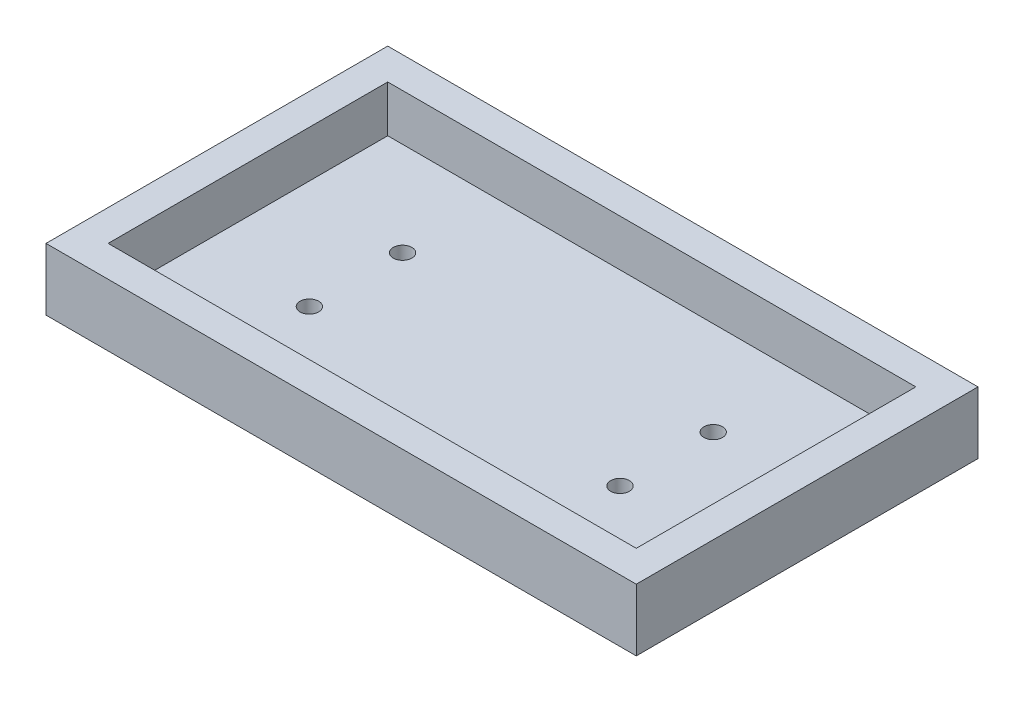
ISO-10303-21;
HEADER;
FILE_DESCRIPTION(('STEP AP214'),'2;1');
FILE_NAME('part.step','',(''),(''),'','','');
FILE_SCHEMA(('AUTOMOTIVE_DESIGN { 1 0 10303 214 1 1 1 1 }'));
ENDSEC;
DATA;
#1=APPLICATION_CONTEXT('core data for automotive mechanical design processes');
#2=APPLICATION_PROTOCOL_DEFINITION('international standard','automotive_design',2000,#1);
#3=PRODUCT_CONTEXT('',#1,'mechanical');
#4=PRODUCT('Part','Part','',(#3));
#5=PRODUCT_RELATED_PRODUCT_CATEGORY('part','',(#4));
#6=PRODUCT_DEFINITION_FORMATION('','',#4);
#7=PRODUCT_DEFINITION_CONTEXT('part definition',#1,'design');
#8=PRODUCT_DEFINITION('design','',#6,#7);
#9=PRODUCT_DEFINITION_SHAPE('','',#8);
#10=(LENGTH_UNIT() NAMED_UNIT(*) SI_UNIT(.MILLI.,.METRE.));
#11=(NAMED_UNIT(*) PLANE_ANGLE_UNIT() SI_UNIT($,.RADIAN.));
#12=(NAMED_UNIT(*) SI_UNIT($,.STERADIAN.) SOLID_ANGLE_UNIT());
#13=UNCERTAINTY_MEASURE_WITH_UNIT(LENGTH_MEASURE(1.E-05),#10,'distance_accuracy_value','');
#14=(GEOMETRIC_REPRESENTATION_CONTEXT(3) GLOBAL_UNCERTAINTY_ASSIGNED_CONTEXT((#13)) GLOBAL_UNIT_ASSIGNED_CONTEXT((#10,
#11,#12)) REPRESENTATION_CONTEXT('',''));
#15=CARTESIAN_POINT('',(0.,0.,0.));
#16=DIRECTION('',(0.,0.,1.));
#17=DIRECTION('',(1.,0.,0.));
#18=AXIS2_PLACEMENT_3D('',#15,#16,#17);
#19=CARTESIAN_POINT('',(0.,15.,0.));
#20=DIRECTION('',(0.,-1.,0.));
#21=DIRECTION('',(0.,0.,-1.));
#22=AXIS2_PLACEMENT_3D('',#19,#20,#21);
#23=PLANE('',#22);
#24=DIRECTION('',(0.,0.,1.));
#25=VECTOR('',#24,1.);
#26=CARTESIAN_POINT('',(-24.5700636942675,15.,94.984076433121));
#27=LINE('',#26,#25);
#28=CARTESIAN_POINT('',(-24.5700636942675,15.,-15.015923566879));
#29=VERTEX_POINT('',#28);
#30=CARTESIAN_POINT('',(-24.5700636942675,15.,94.984076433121));
#31=VERTEX_POINT('',#30);
#32=EDGE_CURVE('E113',#29,#31,#27,.T.);
#33=ORIENTED_EDGE('',*,*,#32,.T.);
#34=DIRECTION('',(1.,0.,0.));
#35=VECTOR('',#34,1.);
#36=CARTESIAN_POINT('',(-24.5700636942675,15.,94.984076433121));
#37=LINE('',#36,#35);
#38=CARTESIAN_POINT('',(165.429936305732,15.,94.984076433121));
#39=VERTEX_POINT('',#38);
#40=EDGE_CURVE('E187',#31,#39,#37,.T.);
#41=ORIENTED_EDGE('',*,*,#40,.T.);
#42=DIRECTION('',(0.,0.,-1.));
#43=VECTOR('',#42,1.);
#44=CARTESIAN_POINT('',(165.429936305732,15.,94.984076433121));
#45=LINE('',#44,#43);
#46=CARTESIAN_POINT('',(165.429936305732,15.,-15.015923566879));
#47=VERTEX_POINT('',#46);
#48=EDGE_CURVE('E190',#39,#47,#45,.T.);
#49=ORIENTED_EDGE('',*,*,#48,.T.);
#50=DIRECTION('',(-1.,0.,0.));
#51=VECTOR('',#50,1.);
#52=CARTESIAN_POINT('',(-24.5700636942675,15.,-15.015923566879));
#53=LINE('',#52,#51);
#54=EDGE_CURVE('E118',#47,#29,#53,.T.);
#55=ORIENTED_EDGE('',*,*,#54,.T.);
#56=EDGE_LOOP('',(#33,#41,#49,#55));
#57=FACE_BOUND('',#56,.T.);
#58=DIRECTION('',(0.,0.,1.));
#59=VECTOR('',#58,1.);
#60=CARTESIAN_POINT('',(-14.5700636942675,15.,-5.015923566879));
#61=LINE('',#60,#59);
#62=CARTESIAN_POINT('',(-14.5700636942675,15.,-5.015923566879));
#63=VERTEX_POINT('',#62);
#64=CARTESIAN_POINT('',(-14.5700636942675,15.,84.984076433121));
#65=VERTEX_POINT('',#64);
#66=EDGE_CURVE('E148',#63,#65,#61,.T.);
#67=ORIENTED_EDGE('',*,*,#66,.F.);
#68=DIRECTION('',(-1.,0.,0.));
#69=VECTOR('',#68,1.);
#70=CARTESIAN_POINT('',(-14.5700636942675,15.,-5.015923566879));
#71=LINE('',#70,#69);
#72=CARTESIAN_POINT('',(155.429936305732,15.,-5.015923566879));
#73=VERTEX_POINT('',#72);
#74=EDGE_CURVE('E158',#73,#63,#71,.T.);
#75=ORIENTED_EDGE('',*,*,#74,.F.);
#76=DIRECTION('',(0.,0.,-1.));
#77=VECTOR('',#76,1.);
#78=CARTESIAN_POINT('',(155.429936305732,15.,-5.015923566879));
#79=LINE('',#78,#77);
#80=CARTESIAN_POINT('',(155.429936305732,15.,84.984076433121));
#81=VERTEX_POINT('',#80);
#82=EDGE_CURVE('E155',#81,#73,#79,.T.);
#83=ORIENTED_EDGE('',*,*,#82,.F.);
#84=DIRECTION('',(1.,0.,0.));
#85=VECTOR('',#84,1.);
#86=CARTESIAN_POINT('',(-14.5700636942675,15.,84.984076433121));
#87=LINE('',#86,#85);
#88=EDGE_CURVE('E151',#65,#81,#87,.T.);
#89=ORIENTED_EDGE('',*,*,#88,.F.);
#90=EDGE_LOOP('',(#67,#75,#83,#89));
#91=FACE_BOUND('',#90,.T.);
#92=ADVANCED_FACE('F39',(#57,#91),#23,.F.);
#93=CARTESIAN_POINT('',(-24.5700636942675,15.,94.984076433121));
#94=DIRECTION('',(1.,0.,0.));
#95=DIRECTION('',(0.,0.,-1.));
#96=AXIS2_PLACEMENT_3D('',#93,#94,#95);
#97=PLANE('',#96);
#98=DIRECTION('',(0.,-1.,0.));
#99=VECTOR('',#98,1.);
#100=CARTESIAN_POINT('',(-24.5700636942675,15.,-15.015923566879));
#101=LINE('',#100,#99);
#102=CARTESIAN_POINT('',(-24.5700636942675,-5.,-15.015923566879));
#103=VERTEX_POINT('',#102);
#104=EDGE_CURVE('E107',#29,#103,#101,.T.);
#105=ORIENTED_EDGE('',*,*,#104,.T.);
#106=DIRECTION('',(0.,0.,-1.));
#107=VECTOR('',#106,1.);
#108=CARTESIAN_POINT('',(-24.5700636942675,-5.,94.984076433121));
#109=LINE('',#108,#107);
#110=CARTESIAN_POINT('',(-24.5700636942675,-5.,94.984076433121));
#111=VERTEX_POINT('',#110);
#112=EDGE_CURVE('E111',#111,#103,#109,.T.);
#113=ORIENTED_EDGE('',*,*,#112,.F.);
#114=DIRECTION('',(0.,-1.,0.));
#115=VECTOR('',#114,1.);
#116=CARTESIAN_POINT('',(-24.5700636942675,15.,94.984076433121));
#117=LINE('',#116,#115);
#118=EDGE_CURVE('E11',#31,#111,#117,.T.);
#119=ORIENTED_EDGE('',*,*,#118,.F.);
#120=ORIENTED_EDGE('',*,*,#32,.F.);
#121=EDGE_LOOP('',(#105,#113,#119,#120));
#122=FACE_BOUND('',#121,.T.);
#123=ADVANCED_FACE('F41',(#122),#97,.F.);
#124=CARTESIAN_POINT('',(-24.5700636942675,15.,94.984076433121));
#125=DIRECTION('',(0.,0.,-1.));
#126=DIRECTION('',(-1.,0.,0.));
#127=AXIS2_PLACEMENT_3D('',#124,#125,#126);
#128=PLANE('',#127);
#129=ORIENTED_EDGE('',*,*,#118,.T.);
#130=DIRECTION('',(-1.,0.,0.));
#131=VECTOR('',#130,1.);
#132=CARTESIAN_POINT('',(-24.5700636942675,-5.,94.984076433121));
#133=LINE('',#132,#131);
#134=CARTESIAN_POINT('',(165.429936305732,-5.,94.984076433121));
#135=VERTEX_POINT('',#134);
#136=EDGE_CURVE('E134',#135,#111,#133,.T.);
#137=ORIENTED_EDGE('',*,*,#136,.F.);
#138=DIRECTION('',(0.,-1.,0.));
#139=VECTOR('',#138,1.);
#140=CARTESIAN_POINT('',(165.429936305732,15.,94.984076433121));
#141=LINE('',#140,#139);
#142=EDGE_CURVE('E48',#39,#135,#141,.T.);
#143=ORIENTED_EDGE('',*,*,#142,.F.);
#144=ORIENTED_EDGE('',*,*,#40,.F.);
#145=EDGE_LOOP('',(#129,#137,#143,#144));
#146=FACE_BOUND('',#145,.T.);
#147=ADVANCED_FACE('F202',(#146),#128,.F.);
#148=CARTESIAN_POINT('',(165.429936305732,15.,94.984076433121));
#149=DIRECTION('',(-1.,0.,0.));
#150=DIRECTION('',(0.,0.,1.));
#151=AXIS2_PLACEMENT_3D('',#148,#149,#150);
#152=PLANE('',#151);
#153=ORIENTED_EDGE('',*,*,#142,.T.);
#154=DIRECTION('',(0.,0.,1.));
#155=VECTOR('',#154,1.);
#156=CARTESIAN_POINT('',(165.429936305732,-5.,94.984076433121));
#157=LINE('',#156,#155);
#158=CARTESIAN_POINT('',(165.429936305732,-5.,-15.015923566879));
#159=VERTEX_POINT('',#158);
#160=EDGE_CURVE('E128',#159,#135,#157,.T.);
#161=ORIENTED_EDGE('',*,*,#160,.F.);
#162=DIRECTION('',(0.,-1.,0.));
#163=VECTOR('',#162,1.);
#164=CARTESIAN_POINT('',(165.429936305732,15.,-15.015923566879));
#165=LINE('',#164,#163);
#166=EDGE_CURVE('E117',#47,#159,#165,.T.);
#167=ORIENTED_EDGE('',*,*,#166,.F.);
#168=ORIENTED_EDGE('',*,*,#48,.F.);
#169=EDGE_LOOP('',(#153,#161,#167,#168));
#170=FACE_BOUND('',#169,.T.);
#171=ADVANCED_FACE('F200',(#170),#152,.F.);
#172=CARTESIAN_POINT('',(-24.5700636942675,15.,-15.015923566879));
#173=DIRECTION('',(0.,0.,1.));
#174=DIRECTION('',(1.,0.,0.));
#175=AXIS2_PLACEMENT_3D('',#172,#173,#174);
#176=PLANE('',#175);
#177=ORIENTED_EDGE('',*,*,#166,.T.);
#178=DIRECTION('',(1.,0.,0.));
#179=VECTOR('',#178,1.);
#180=CARTESIAN_POINT('',(-24.5700636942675,-5.,-15.015923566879));
#181=LINE('',#180,#179);
#182=EDGE_CURVE('E121',#103,#159,#181,.T.);
#183=ORIENTED_EDGE('',*,*,#182,.F.);
#184=ORIENTED_EDGE('',*,*,#104,.F.);
#185=ORIENTED_EDGE('',*,*,#54,.F.);
#186=EDGE_LOOP('',(#177,#183,#184,#185));
#187=FACE_BOUND('',#186,.T.);
#188=ADVANCED_FACE('F122',(#187),#176,.F.);
#189=CARTESIAN_POINT('',(-14.5700636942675,15.,-5.015923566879));
#190=DIRECTION('',(1.,0.,0.));
#191=DIRECTION('',(0.,0.,-1.));
#192=AXIS2_PLACEMENT_3D('',#189,#190,#191);
#193=PLANE('',#192);
#194=DIRECTION('',(0.,0.,1.));
#195=VECTOR('',#194,1.);
#196=CARTESIAN_POINT('',(-14.5700636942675,0.,-5.015923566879));
#197=LINE('',#196,#195);
#198=CARTESIAN_POINT('',(-14.5700636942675,0.,-5.015923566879));
#199=VERTEX_POINT('',#198);
#200=CARTESIAN_POINT('',(-14.5700636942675,0.,84.984076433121));
#201=VERTEX_POINT('',#200);
#202=EDGE_CURVE('E63',#199,#201,#197,.T.);
#203=ORIENTED_EDGE('',*,*,#202,.F.);
#204=DIRECTION('',(0.,-1.,0.));
#205=VECTOR('',#204,1.);
#206=CARTESIAN_POINT('',(-14.5700636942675,15.,-5.015923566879));
#207=LINE('',#206,#205);
#208=EDGE_CURVE('E161',#63,#199,#207,.T.);
#209=ORIENTED_EDGE('',*,*,#208,.F.);
#210=ORIENTED_EDGE('',*,*,#66,.T.);
#211=DIRECTION('',(0.,-1.,0.));
#212=VECTOR('',#211,1.);
#213=CARTESIAN_POINT('',(-14.5700636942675,15.,84.984076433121));
#214=LINE('',#213,#212);
#215=EDGE_CURVE('E182',#65,#201,#214,.T.);
#216=ORIENTED_EDGE('',*,*,#215,.T.);
#217=EDGE_LOOP('',(#203,#209,#210,#216));
#218=FACE_BOUND('',#217,.T.);
#219=ADVANCED_FACE('F212',(#218),#193,.T.);
#220=CARTESIAN_POINT('',(-14.5700636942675,15.,84.984076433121));
#221=DIRECTION('',(0.,0.,-1.));
#222=DIRECTION('',(-1.,0.,0.));
#223=AXIS2_PLACEMENT_3D('',#220,#221,#222);
#224=PLANE('',#223);
#225=DIRECTION('',(1.,0.,0.));
#226=VECTOR('',#225,1.);
#227=CARTESIAN_POINT('',(-14.5700636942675,0.,84.984076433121));
#228=LINE('',#227,#226);
#229=CARTESIAN_POINT('',(155.429936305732,0.,84.984076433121));
#230=VERTEX_POINT('',#229);
#231=EDGE_CURVE('E164',#201,#230,#228,.T.);
#232=ORIENTED_EDGE('',*,*,#231,.F.);
#233=ORIENTED_EDGE('',*,*,#215,.F.);
#234=ORIENTED_EDGE('',*,*,#88,.T.);
#235=DIRECTION('',(0.,-1.,0.));
#236=VECTOR('',#235,1.);
#237=CARTESIAN_POINT('',(155.429936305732,15.,84.984076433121));
#238=LINE('',#237,#236);
#239=EDGE_CURVE('E179',#81,#230,#238,.T.);
#240=ORIENTED_EDGE('',*,*,#239,.T.);
#241=EDGE_LOOP('',(#232,#233,#234,#240));
#242=FACE_BOUND('',#241,.T.);
#243=ADVANCED_FACE('F214',(#242),#224,.T.);
#244=CARTESIAN_POINT('',(155.429936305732,15.,-5.015923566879));
#245=DIRECTION('',(-1.,0.,0.));
#246=DIRECTION('',(0.,0.,1.));
#247=AXIS2_PLACEMENT_3D('',#244,#245,#246);
#248=PLANE('',#247);
#249=DIRECTION('',(0.,0.,-1.));
#250=VECTOR('',#249,1.);
#251=CARTESIAN_POINT('',(155.429936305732,0.,-5.015923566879));
#252=LINE('',#251,#250);
#253=CARTESIAN_POINT('',(155.429936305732,0.,-5.015923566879));
#254=VERTEX_POINT('',#253);
#255=EDGE_CURVE('E168',#230,#254,#252,.T.);
#256=ORIENTED_EDGE('',*,*,#255,.F.);
#257=ORIENTED_EDGE('',*,*,#239,.F.);
#258=ORIENTED_EDGE('',*,*,#82,.T.);
#259=DIRECTION('',(0.,-1.,0.));
#260=VECTOR('',#259,1.);
#261=CARTESIAN_POINT('',(155.429936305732,15.,-5.015923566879));
#262=LINE('',#261,#260);
#263=EDGE_CURVE('E55',#73,#254,#262,.T.);
#264=ORIENTED_EDGE('',*,*,#263,.T.);
#265=EDGE_LOOP('',(#256,#257,#258,#264));
#266=FACE_BOUND('',#265,.T.);
#267=ADVANCED_FACE('F221',(#266),#248,.T.);
#268=CARTESIAN_POINT('',(-14.5700636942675,15.,-5.015923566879));
#269=DIRECTION('',(0.,0.,1.));
#270=DIRECTION('',(1.,0.,0.));
#271=AXIS2_PLACEMENT_3D('',#268,#269,#270);
#272=PLANE('',#271);
#273=DIRECTION('',(-1.,0.,0.));
#274=VECTOR('',#273,1.);
#275=CARTESIAN_POINT('',(-14.5700636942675,0.,-5.015923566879));
#276=LINE('',#275,#274);
#277=EDGE_CURVE('E152',#254,#199,#276,.T.);
#278=ORIENTED_EDGE('',*,*,#277,.F.);
#279=ORIENTED_EDGE('',*,*,#263,.F.);
#280=ORIENTED_EDGE('',*,*,#74,.T.);
#281=ORIENTED_EDGE('',*,*,#208,.T.);
#282=EDGE_LOOP('',(#278,#279,#280,#281));
#283=FACE_BOUND('',#282,.T.);
#284=ADVANCED_FACE('F219',(#283),#272,.T.);
#285=CARTESIAN_POINT('',(0.,0.,0.));
#286=DIRECTION('',(0.,-1.,0.));
#287=DIRECTION('',(0.,0.,-1.));
#288=AXIS2_PLACEMENT_3D('',#285,#286,#287);
#289=PLANE('',#288);
#290=CARTESIAN_POINT('',(120.429936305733,0.,55.209797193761));
#291=DIRECTION('',(0.,-1.,0.));
#292=DIRECTION('',(0.,0.,-1.));
#293=AXIS2_PLACEMENT_3D('',#290,#291,#292);
#294=CIRCLE('',#293,3.00000000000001);
#295=CARTESIAN_POINT('',(120.429936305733,0.,52.209797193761));
#296=VERTEX_POINT('',#295);
#297=EDGE_CURVE('E359',#296,#296,#294,.T.);
#298=ORIENTED_EDGE('',*,*,#297,.T.);
#299=EDGE_LOOP('',(#298));
#300=FACE_BOUND('',#299,.T.);
#301=CARTESIAN_POINT('',(20.4299363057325,0.,55.209797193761));
#302=DIRECTION('',(0.,-1.,0.));
#303=DIRECTION('',(0.,0.,-1.));
#304=AXIS2_PLACEMENT_3D('',#301,#302,#303);
#305=CIRCLE('',#304,3.);
#306=CARTESIAN_POINT('',(20.4299363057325,0.,52.209797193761));
#307=VERTEX_POINT('',#306);
#308=EDGE_CURVE('E363',#307,#307,#305,.T.);
#309=ORIENTED_EDGE('',*,*,#308,.T.);
#310=EDGE_LOOP('',(#309));
#311=FACE_BOUND('',#310,.T.);
#312=CARTESIAN_POINT('',(120.429936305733,0.,25.209797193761));
#313=DIRECTION('',(0.,-1.,0.));
#314=DIRECTION('',(0.,0.,-1.));
#315=AXIS2_PLACEMENT_3D('',#312,#313,#314);
#316=CIRCLE('',#315,3.00000000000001);
#317=CARTESIAN_POINT('',(120.429936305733,0.,22.209797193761));
#318=VERTEX_POINT('',#317);
#319=EDGE_CURVE('E370',#318,#318,#316,.T.);
#320=ORIENTED_EDGE('',*,*,#319,.T.);
#321=EDGE_LOOP('',(#320));
#322=FACE_BOUND('',#321,.T.);
#323=CARTESIAN_POINT('',(20.4299363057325,0.,25.209797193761));
#324=DIRECTION('',(0.,-1.,0.));
#325=DIRECTION('',(0.,0.,-1.));
#326=AXIS2_PLACEMENT_3D('',#323,#324,#325);
#327=CIRCLE('',#326,3.);
#328=CARTESIAN_POINT('',(20.4299363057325,0.,22.209797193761));
#329=VERTEX_POINT('',#328);
#330=EDGE_CURVE('E140',#329,#329,#327,.T.);
#331=ORIENTED_EDGE('',*,*,#330,.T.);
#332=EDGE_LOOP('',(#331));
#333=FACE_BOUND('',#332,.T.);
#334=ORIENTED_EDGE('',*,*,#255,.T.);
#335=ORIENTED_EDGE('',*,*,#277,.T.);
#336=ORIENTED_EDGE('',*,*,#202,.T.);
#337=ORIENTED_EDGE('',*,*,#231,.T.);
#338=EDGE_LOOP('',(#334,#335,#336,#337));
#339=FACE_BOUND('',#338,.T.);
#340=ADVANCED_FACE('F218',(#300,#311,#322,#333,#339),#289,.F.);
#341=CARTESIAN_POINT('',(0.,-5.,0.));
#342=DIRECTION('',(0.,-1.,0.));
#343=DIRECTION('',(0.,0.,-1.));
#344=AXIS2_PLACEMENT_3D('',#341,#342,#343);
#345=PLANE('',#344);
#346=CARTESIAN_POINT('',(20.4299363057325,-5.,55.209797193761));
#347=DIRECTION('',(0.,-1.,0.));
#348=DIRECTION('',(0.,0.,-1.));
#349=AXIS2_PLACEMENT_3D('',#346,#347,#348);
#350=CIRCLE('',#349,3.);
#351=CARTESIAN_POINT('',(20.4299363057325,-5.,52.209797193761));
#352=VERTEX_POINT('',#351);
#353=EDGE_CURVE('E366',#352,#352,#350,.T.);
#354=ORIENTED_EDGE('',*,*,#353,.F.);
#355=EDGE_LOOP('',(#354));
#356=FACE_BOUND('',#355,.T.);
#357=CARTESIAN_POINT('',(20.4299363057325,-5.,25.209797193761));
#358=DIRECTION('',(0.,-1.,0.));
#359=DIRECTION('',(0.,0.,-1.));
#360=AXIS2_PLACEMENT_3D('',#357,#358,#359);
#361=CIRCLE('',#360,3.);
#362=CARTESIAN_POINT('',(20.4299363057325,-5.,22.209797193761));
#363=VERTEX_POINT('',#362);
#364=EDGE_CURVE('E136',#363,#363,#361,.T.);
#365=ORIENTED_EDGE('',*,*,#364,.F.);
#366=EDGE_LOOP('',(#365));
#367=FACE_BOUND('',#366,.T.);
#368=ORIENTED_EDGE('',*,*,#112,.T.);
#369=ORIENTED_EDGE('',*,*,#182,.T.);
#370=ORIENTED_EDGE('',*,*,#160,.T.);
#371=ORIENTED_EDGE('',*,*,#136,.T.);
#372=EDGE_LOOP('',(#368,#369,#370,#371));
#373=FACE_BOUND('',#372,.T.);
#374=CARTESIAN_POINT('',(120.429936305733,-5.,25.209797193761));
#375=DIRECTION('',(0.,-1.,0.));
#376=DIRECTION('',(0.,0.,-1.));
#377=AXIS2_PLACEMENT_3D('',#374,#375,#376);
#378=CIRCLE('',#377,3.00000000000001);
#379=CARTESIAN_POINT('',(120.429936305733,-5.,22.209797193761));
#380=VERTEX_POINT('',#379);
#381=EDGE_CURVE('E374',#380,#380,#378,.T.);
#382=ORIENTED_EDGE('',*,*,#381,.F.);
#383=EDGE_LOOP('',(#382));
#384=FACE_BOUND('',#383,.T.);
#385=CARTESIAN_POINT('',(120.429936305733,-5.,55.209797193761));
#386=DIRECTION('',(0.,-1.,0.));
#387=DIRECTION('',(0.,0.,-1.));
#388=AXIS2_PLACEMENT_3D('',#385,#386,#387);
#389=CIRCLE('',#388,3.00000000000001);
#390=CARTESIAN_POINT('',(120.429936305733,-5.,52.209797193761));
#391=VERTEX_POINT('',#390);
#392=EDGE_CURVE('E356',#391,#391,#389,.T.);
#393=ORIENTED_EDGE('',*,*,#392,.F.);
#394=EDGE_LOOP('',(#393));
#395=FACE_BOUND('',#394,.T.);
#396=ADVANCED_FACE('F131',(#356,#367,#373,#384,#395),#345,.T.);
#397=CARTESIAN_POINT('',(20.4299363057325,-5.,25.209797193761));
#398=DIRECTION('',(0.,1.,0.));
#399=DIRECTION('',(0.,0.,1.));
#400=AXIS2_PLACEMENT_3D('',#397,#398,#399);
#401=CYLINDRICAL_SURFACE('',#400,3.);
#402=ORIENTED_EDGE('',*,*,#364,.T.);
#403=EDGE_LOOP('',(#402));
#404=FACE_BOUND('',#403,.T.);
#405=ORIENTED_EDGE('',*,*,#330,.F.);
#406=EDGE_LOOP('',(#405));
#407=FACE_BOUND('',#406,.T.);
#408=ADVANCED_FACE('F309',(#404,#407),#401,.F.);
#409=CARTESIAN_POINT('',(120.429936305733,-5.,25.209797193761));
#410=DIRECTION('',(0.,1.,0.));
#411=DIRECTION('',(0.,0.,1.));
#412=AXIS2_PLACEMENT_3D('',#409,#410,#411);
#413=CYLINDRICAL_SURFACE('',#412,3.00000000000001);
#414=ORIENTED_EDGE('',*,*,#381,.T.);
#415=EDGE_LOOP('',(#414));
#416=FACE_BOUND('',#415,.T.);
#417=ORIENTED_EDGE('',*,*,#319,.F.);
#418=EDGE_LOOP('',(#417));
#419=FACE_BOUND('',#418,.T.);
#420=ADVANCED_FACE('F319',(#416,#419),#413,.F.);
#421=CARTESIAN_POINT('',(20.4299363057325,-5.,55.209797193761));
#422=DIRECTION('',(0.,1.,0.));
#423=DIRECTION('',(0.,0.,1.));
#424=AXIS2_PLACEMENT_3D('',#421,#422,#423);
#425=CYLINDRICAL_SURFACE('',#424,3.);
#426=ORIENTED_EDGE('',*,*,#353,.T.);
#427=EDGE_LOOP('',(#426));
#428=FACE_BOUND('',#427,.T.);
#429=ORIENTED_EDGE('',*,*,#308,.F.);
#430=EDGE_LOOP('',(#429));
#431=FACE_BOUND('',#430,.T.);
#432=ADVANCED_FACE('F329',(#428,#431),#425,.F.);
#433=CARTESIAN_POINT('',(120.429936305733,-5.,55.209797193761));
#434=DIRECTION('',(0.,1.,0.));
#435=DIRECTION('',(0.,0.,1.));
#436=AXIS2_PLACEMENT_3D('',#433,#434,#435);
#437=CYLINDRICAL_SURFACE('',#436,3.00000000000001);
#438=ORIENTED_EDGE('',*,*,#392,.T.);
#439=EDGE_LOOP('',(#438));
#440=FACE_BOUND('',#439,.T.);
#441=ORIENTED_EDGE('',*,*,#297,.F.);
#442=EDGE_LOOP('',(#441));
#443=FACE_BOUND('',#442,.T.);
#444=ADVANCED_FACE('F339',(#440,#443),#437,.F.);
#445=CLOSED_SHELL('',(#92,#123,#147,#171,#188,#219,#243,#267,#284,#340,#396,#408,#420,#432,#444));
#446=MANIFOLD_SOLID_BREP('B2',#445);
#447=ADVANCED_BREP_SHAPE_REPRESENTATION('',(#18,#446),#14);
#448=SHAPE_DEFINITION_REPRESENTATION(#9,#447);
ENDSEC;
END-ISO-10303-21;
